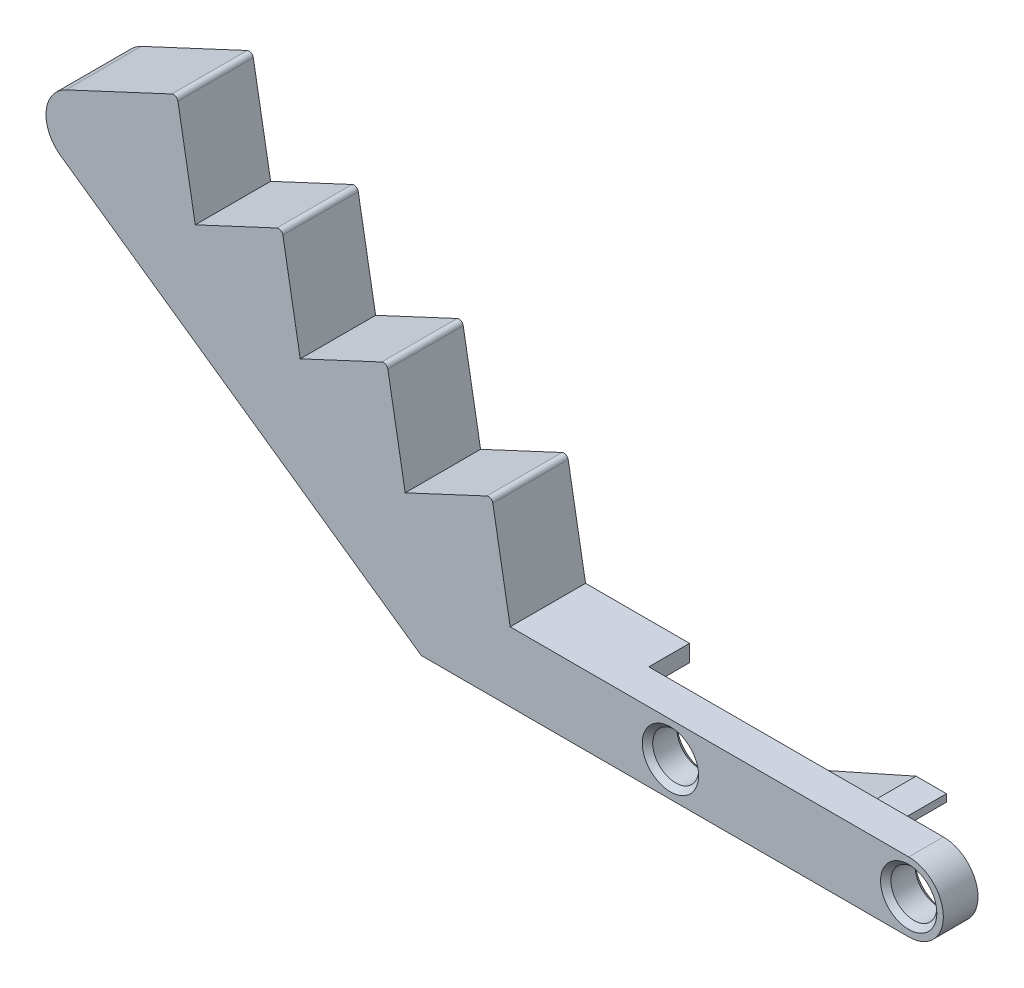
from build123d import *

# Parameters (mm, degrees)
BOSS_EXTRUDE1_DEPTH                      = 4
SKETCH2_R                                = 2.65
CUT_EXTRUDE1_DEPTH                       = 33.003906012
CHAMFER2_SIZE                            = 0.6
CHAMFER3_SIZE                            = 0.6
CHAMFER4_SIZE                            = 0.6
CHAMFER5_SIZE                            = 0.6
CHAMFER6_SIZE                            = 0.6
CHAMFER7_SIZE                            = 0.6
BOSS_EXTRUDE2_DEPTH                      = 4.7
MIRROR1_AT_THE_SECOND_PLANE_COPY_1_DEPTH = 4.7
CUT_EXTRUDE2_DEPTH                       = 4.7
BOSS_EXTRUDE3_START                      = -4.000001
BOSS_EXTRUDE3_DEPTH                      = 8.700001


with BuildPart() as part:
    # Sketch1 → Boss-Extrude1 (new body)
    with BuildSketch(Plane.XY):
        with BuildLine():
            Line((-27.5, 4), (27.5, 4))
            ThreePointArc((27.5, 4), (31.5, 0), (27.5, -4))
            Line((27.5, -4), (-27.5, -4))
            ThreePointArc((-27.5, -4), (-31.5, 0), (-27.5, 4))
        make_face()
    extrude(amount=BOSS_EXTRUDE1_DEPTH)

    # Sketch2 → Cut-Extrude1 (cut, through all)
    with BuildSketch(Plane.XY.offset(4)):
        with Locations((-27.5, 0)):
            Circle(SKETCH2_R)
        Circle(SKETCH2_R)
        with Locations((27.5, 0)):
            Circle(SKETCH2_R)
    extrude(amount=-CUT_EXTRUDE1_DEPTH, mode=Mode.SUBTRACT)

    # Chamfer2
    chamfer2_edges = [part.edges().sort_by_distance(p)[0] for p in [
        (-30.15, 0, 4),
    ]]
    chamfer(chamfer2_edges, length=CHAMFER2_SIZE)

    # Chamfer3
    chamfer3_edges = [part.edges().sort_by_distance(p)[0] for p in [
        (-30.15, 0, 0),
    ]]
    chamfer(chamfer3_edges, length=CHAMFER3_SIZE)

    # Chamfer4
    chamfer4_edges = [part.edges().sort_by_distance(p)[0] for p in [
        (-2.65, 0, 0),
    ]]
    chamfer(chamfer4_edges, length=CHAMFER4_SIZE)

    # Chamfer5
    chamfer5_edges = [part.edges().sort_by_distance(p)[0] for p in [
        (-2.65, 0, 4),
    ]]
    chamfer(chamfer5_edges, length=CHAMFER5_SIZE)

    # Chamfer6
    chamfer6_edges = [part.edges().sort_by_distance(p)[0] for p in [
        (24.85, 0, 0),
    ]]
    chamfer(chamfer6_edges, length=CHAMFER6_SIZE)

    # Chamfer7
    chamfer7_edges = [part.edges().sort_by_distance(p)[0] for p in [
        (24.85, 0, 4),
    ]]
    chamfer(chamfer7_edges, length=CHAMFER7_SIZE)

    # Sketch5 → Boss-Extrude2 (add)
    with BuildSketch(Plane(origin=(0, 0, 0), x_dir=(-1, 0, 0), z_dir=(0, 0, -1))):
        Polygon((-23.160974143, 3.8), (-23.160974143, 2.950100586), (-8, -3.8), (-6.5, -3.8), (-6.5, -2.059643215), (-19.660974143, 3.8), align=None)
    boss_extrude2 = extrude(amount=BOSS_EXTRUDE2_DEPTH)

    # Mirror1: Boss-Extrude2 across plane
    add(boss_extrude2.mirror(Plane.ZX))

    # Mirror1 at the second plane: Boss-Extrude2 across plane
    add(boss_extrude2.mirror(Plane(origin=(0, 0, 0), x_dir=(0, 0, 1), z_dir=(1, 0, 0))))

    # Mirror1 at the second plane copy 1 sketc → Mirror1 at the second plane copy 1 (add)
    with BuildSketch(Plane(origin=(0, 0, 0), x_dir=(1, 0, 0), z_dir=(0, 0, -1))):
        Polygon((-23.160974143, 3.8), (-23.160974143, 2.950100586), (-8, -3.8), (-6.5, -3.8), (-6.5, -2.059643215), (-19.660974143, 3.8), align=None)
    extrude(amount=MIRROR1_AT_THE_SECOND_PLANE_COPY_1_DEPTH)

    # Sketch6 → Cut-Extrude2 (cut)
    with BuildSketch(Plane(origin=(0, 0, -4.7), x_dir=(-1, 0, 0), z_dir=(0, 0, -1))):
        Polygon((-15.104761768, 1.771443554), (-8.751545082, -1.057190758), (-4.110286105, 2.51311457), (-7.246807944, 7.601438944), align=None)
        Polygon((-17.626641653, 0.486057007), (-11.719631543, -2.143913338), (-16.648904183, -6.318754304), (-25.764538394, -5.234239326), (-21.9821284, -0.188886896), align=None)
        Polygon((8.58421018, 1.131693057), (14.703742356, -1.592898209), (6.44241206, -5.612978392), (4.525753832, -0.382775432), align=None)
        Polygon((11.983222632, 2.026555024), (17.758594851, -0.544806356), (24.258021, 3.436897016), (16.813955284, 7.91240132), align=None)
    extrude(amount=-CUT_EXTRUDE2_DEPTH, mode=Mode.SUBTRACT)

    # Sketch7 → Boss-Extrude3 (add)
    with BuildSketch(Plane(origin=(0, 0, 0), x_dir=(-1, 0, 0), z_dir=(0, 0, -1)).offset(BOSS_EXTRUDE3_START)):
        with BuildLine():
            Line((20.110181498, -4), (28.761195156, -4))
            Line((28.761195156, -4), (70.373635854, 25.13734466))
            ThreePointArc((70.373635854, 25.13734466), (72.064108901, 28.762575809), (69.769803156, 32.039183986))
            Line((69.769803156, 32.039183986), (57.554256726, 37.735386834))
            ThreePointArc((57.554256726, 37.735386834), (57.112073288, 37.725738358), (56.850543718, 37.36905703))
            Line((56.850543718, 37.36905703), (54.847771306, 26.010770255))
            Line((54.847771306, 26.010770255), (45.438332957, 30.398463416))
            ThreePointArc((45.438332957, 30.398463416), (44.99614952, 30.388814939), (44.73461995, 30.032133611))
            Line((44.73461995, 30.032133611), (42.731847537, 18.673846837))
            Line((42.731847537, 18.673846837), (33.322409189, 23.061539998))
            ThreePointArc((33.322409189, 23.061539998), (32.880225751, 23.051891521), (32.618696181, 22.695210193))
            Line((32.618696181, 22.695210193), (30.615923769, 11.336923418))
            Line((30.615923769, 11.336923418), (21.20648542, 15.724616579))
            ThreePointArc((21.20648542, 15.724616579), (20.764301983, 15.714968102), (20.502772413, 15.358286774))
            Line((20.502772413, 15.358286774), (18.5, 4))
            Line((18.5, 4), (6.5, 4))
            Line((6.5, 4), (6.5, 2.059643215))
            Line((6.5, 2.059643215), (20.110181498, -4))
        make_face()
    extrude(amount=BOSS_EXTRUDE3_DEPTH)


solid = part.part
